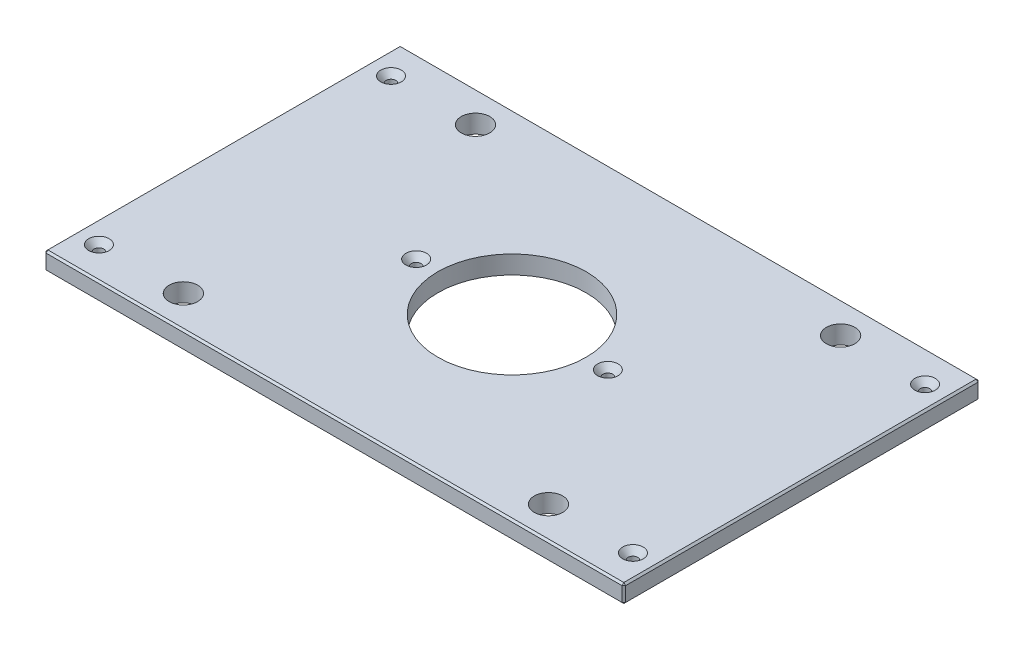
from build123d import *

# Parameters (mm, degrees)
SKETCH1_W                                        = 403.225
SKETCH1_H                                        = 247.65
BOSS_EXTRUDE1_DEPTH                              = 12.7
SKETCH13_R                                       = 51.562
CUT_EXTRUDE6_DEPTH                               = 237.942019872
F_25_32_0_78125_DIAMETER_HOLE1_D                 = 19.84375
CHAMFER2_SIZE                                    = 1.27
CSK_FOR_1_4_FLAT_HEAD_MACHINE_SCREW1_D           = 6.7564
CSK_FOR_1_4_FLAT_HEAD_MACHINE_SCREW1_CSINK_D     = 14.2748
CSK_FOR_1_4_FLAT_HEAD_MACHINE_SCREW1_CSINK_ANGLE = 82


with BuildPart() as part:
    # Sketch1 → Boss-Extrude1 (new body)
    with BuildSketch(Plane(origin=(0, 0, 0), x_dir=(1, 0, 0), z_dir=(0, 1, 0))):
        Rectangle(SKETCH1_W, SKETCH1_H)
    extrude(amount=BOSS_EXTRUDE1_DEPTH)

    # Sketch13 → Cut-Extrude6 (cut, through all)
    with BuildSketch(Plane(origin=(0, 12.7, 0), x_dir=(1, 0, 0), z_dir=(0, 1, 0))):
        with Locations(Location((0, 0, 0), (0, 0, 270))):
            Circle(SKETCH13_R)
    extrude(amount=-CUT_EXTRUDE6_DEPTH, mode=Mode.SUBTRACT)

    # 25_32 _0.78125_ Diameter Hole1 (through all)
    with Locations(Plane(origin=(0, 12.7, 0), x_dir=(1, 0, 0), z_dir=(0, 1, 0))):
        with Locations((127, 101.6), (-127, 101.6), (127, -101.6), (-127, -101.6)):
            Hole(F_25_32_0_78125_DIAMETER_HOLE1_D / 2)

    # Chamfer2
    chamfer2_edges = [part.edges().sort_by_distance(p)[0] for p in [
        (201.6125, 12.7, 0),
        (0, 12.7, -123.825),
        (-201.6125, 12.7, 0),
        (0, 0, -123.825),
        (201.6125, 0, 0),
        (0, 0, 123.825),
        (-201.6125, 0, 0),
        (0, 12.7, 123.825),
        (-201.6125, 6.35, -123.825),
        (201.6125, 6.35, -123.825),
        (201.6125, 6.35, 123.825),
        (-201.6125, 6.35, 123.825),
    ]]
    chamfer(chamfer2_edges, length=CHAMFER2_SIZE)

    # CSK for 1_4 Flat Head Machine Screw1 (through all)
    with Locations(Plane(origin=(0, 12.7, 0), x_dir=(1, 0, 0), z_dir=(0, 1, 0))):
        with Locations((185.7375, 101.6), (185.7375, -101.6), (-185.7375, -101.6), (-66.675, 0), (66.675, 0), (-185.7375, 101.6), (-127, 101.6), (-127, -101.6)):
            CounterSinkHole(CSK_FOR_1_4_FLAT_HEAD_MACHINE_SCREW1_D / 2, CSK_FOR_1_4_FLAT_HEAD_MACHINE_SCREW1_CSINK_D / 2, counter_sink_angle=CSK_FOR_1_4_FLAT_HEAD_MACHINE_SCREW1_CSINK_ANGLE)


solid = part.part
